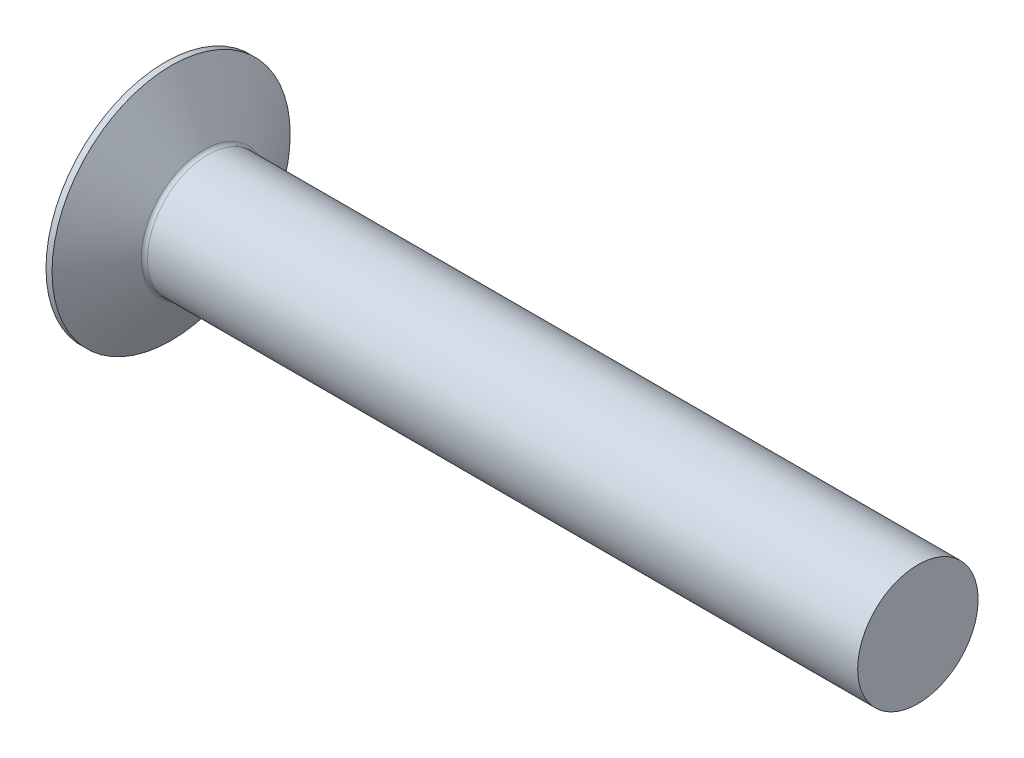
ISO-10303-21;
HEADER;
FILE_DESCRIPTION(('STEP AP214'),'2;1');
FILE_NAME('part.step','',(''),(''),'','','');
FILE_SCHEMA(('AUTOMOTIVE_DESIGN { 1 0 10303 214 1 1 1 1 }'));
ENDSEC;
DATA;
#1=APPLICATION_CONTEXT('core data for automotive mechanical design processes');
#2=APPLICATION_PROTOCOL_DEFINITION('international standard','automotive_design',2000,#1);
#3=PRODUCT_CONTEXT('',#1,'mechanical');
#4=PRODUCT('Part','Part','',(#3));
#5=PRODUCT_RELATED_PRODUCT_CATEGORY('part','',(#4));
#6=PRODUCT_DEFINITION_FORMATION('','',#4);
#7=PRODUCT_DEFINITION_CONTEXT('part definition',#1,'design');
#8=PRODUCT_DEFINITION('design','',#6,#7);
#9=PRODUCT_DEFINITION_SHAPE('','',#8);
#10=(LENGTH_UNIT() NAMED_UNIT(*) SI_UNIT(.MILLI.,.METRE.));
#11=(NAMED_UNIT(*) PLANE_ANGLE_UNIT() SI_UNIT($,.RADIAN.));
#12=(NAMED_UNIT(*) SI_UNIT($,.STERADIAN.) SOLID_ANGLE_UNIT());
#13=UNCERTAINTY_MEASURE_WITH_UNIT(LENGTH_MEASURE(1.E-05),#10,'distance_accuracy_value','');
#14=(GEOMETRIC_REPRESENTATION_CONTEXT(3) GLOBAL_UNCERTAINTY_ASSIGNED_CONTEXT((#13)) GLOBAL_UNIT_ASSIGNED_CONTEXT((#10,
#11,#12)) REPRESENTATION_CONTEXT('',''));
#15=CARTESIAN_POINT('',(0.,0.,0.));
#16=DIRECTION('',(0.,0.,1.));
#17=DIRECTION('',(1.,0.,0.));
#18=AXIS2_PLACEMENT_3D('',#15,#16,#17);
#19=CARTESIAN_POINT('',(0.,7.91000000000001,0.));
#20=DIRECTION('',(1.,0.,0.));
#21=DIRECTION('',(0.,0.,-1.));
#22=AXIS2_PLACEMENT_3D('',#19,#20,#21);
#23=PLANE('',#22);
#24=CARTESIAN_POINT('',(0.,0.,0.));
#25=DIRECTION('',(-1.,0.,0.));
#26=DIRECTION('',(0.,0.,1.));
#27=AXIS2_PLACEMENT_3D('',#24,#25,#26);
#28=CIRCLE('',#27,7.91000000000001);
#29=CARTESIAN_POINT('',(0.,0.,7.91000000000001));
#30=VERTEX_POINT('',#29);
#31=EDGE_CURVE('E10',#30,#30,#28,.T.);
#32=ORIENTED_EDGE('',*,*,#31,.T.);
#33=EDGE_LOOP('',(#32));
#34=FACE_BOUND('',#33,.T.);
#35=ADVANCED_FACE('F37',(#34),#23,.F.);
#36=CARTESIAN_POINT('',(-69.0695530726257,0.,0.));
#37=DIRECTION('',(-1.,0.,0.));
#38=DIRECTION('',(0.,0.,1.));
#39=AXIS2_PLACEMENT_3D('',#36,#37,#38);
#40=CYLINDRICAL_SURFACE('',#39,7.91000000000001);
#41=ORIENTED_EDGE('',*,*,#31,.F.);
#42=EDGE_LOOP('',(#41));
#43=FACE_BOUND('',#42,.T.);
#44=CARTESIAN_POINT('',(0.399999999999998,0.,0.));
#45=DIRECTION('',(-1.,0.,0.));
#46=DIRECTION('',(0.,0.,1.));
#47=AXIS2_PLACEMENT_3D('',#44,#45,#46);
#48=CIRCLE('',#47,7.91000000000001);
#49=CARTESIAN_POINT('',(0.399999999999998,0.,7.91000000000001));
#50=VERTEX_POINT('',#49);
#51=EDGE_CURVE('E43',#50,#50,#48,.T.);
#52=ORIENTED_EDGE('',*,*,#51,.T.);
#53=EDGE_LOOP('',(#52));
#54=FACE_BOUND('',#53,.T.);
#55=ADVANCED_FACE('F72',(#43,#54),#40,.T.);
#56=CARTESIAN_POINT('',(2.57083701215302,0.,0.));
#57=DIRECTION('',(-1.,0.,0.));
#58=DIRECTION('',(0.,0.,1.));
#59=AXIS2_PLACEMENT_3D('',#56,#57,#58);
#60=CONICAL_SURFACE('',#59,4.14999999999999,1.04719755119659);
#61=ORIENTED_EDGE('',*,*,#51,.F.);
#62=EDGE_LOOP('',(#61));
#63=FACE_BOUND('',#62,.T.);
#64=CARTESIAN_POINT('',(2.57083701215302,0.,0.));
#65=DIRECTION('',(-1.,0.,0.));
#66=DIRECTION('',(0.,0.,1.));
#67=AXIS2_PLACEMENT_3D('',#64,#65,#66);
#68=CIRCLE('',#67,4.14999999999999);
#69=CARTESIAN_POINT('',(2.57083701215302,0.,4.14999999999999));
#70=VERTEX_POINT('',#69);
#71=EDGE_CURVE('E47',#70,#70,#68,.T.);
#72=ORIENTED_EDGE('',*,*,#71,.T.);
#73=EDGE_LOOP('',(#72));
#74=FACE_BOUND('',#73,.T.);
#75=ADVANCED_FACE('F76',(#63,#74),#60,.T.);
#76=CARTESIAN_POINT('',(2.83064463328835,0.,0.));
#77=DIRECTION('',(-1.,0.,0.));
#78=DIRECTION('',(0.,0.,1.));
#79=AXIS2_PLACEMENT_3D('',#76,#77,#78);
#80=TOROIDAL_SURFACE('',#79,4.3,0.300000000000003);
#81=ORIENTED_EDGE('',*,*,#71,.F.);
#82=EDGE_LOOP('',(#81));
#83=FACE_BOUND('',#82,.T.);
#84=CARTESIAN_POINT('',(2.83064463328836,0.,0.));
#85=DIRECTION('',(-1.,0.,0.));
#86=DIRECTION('',(0.,0.,1.));
#87=AXIS2_PLACEMENT_3D('',#84,#85,#86);
#88=CIRCLE('',#87,3.99999999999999);
#89=CARTESIAN_POINT('',(2.83064463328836,0.,3.99999999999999));
#90=VERTEX_POINT('',#89);
#91=EDGE_CURVE('E51',#90,#90,#88,.T.);
#92=ORIENTED_EDGE('',*,*,#91,.T.);
#93=EDGE_LOOP('',(#92));
#94=FACE_BOUND('',#93,.T.);
#95=ADVANCED_FACE('F68',(#83,#94),#80,.F.);
#96=CARTESIAN_POINT('',(-69.0695530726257,0.,0.));
#97=DIRECTION('',(-1.,0.,0.));
#98=DIRECTION('',(0.,0.,1.));
#99=AXIS2_PLACEMENT_3D('',#96,#97,#98);
#100=CYLINDRICAL_SURFACE('',#99,4.);
#101=ORIENTED_EDGE('',*,*,#91,.F.);
#102=EDGE_LOOP('',(#101));
#103=FACE_BOUND('',#102,.T.);
#104=CARTESIAN_POINT('',(50.,0.,0.));
#105=DIRECTION('',(-1.,0.,0.));
#106=DIRECTION('',(0.,0.,1.));
#107=AXIS2_PLACEMENT_3D('',#104,#105,#106);
#108=CIRCLE('',#107,4.00000000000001);
#109=CARTESIAN_POINT('',(50.,0.,4.00000000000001));
#110=VERTEX_POINT('',#109);
#111=EDGE_CURVE('E56',#110,#110,#108,.T.);
#112=ORIENTED_EDGE('',*,*,#111,.T.);
#113=EDGE_LOOP('',(#112));
#114=FACE_BOUND('',#113,.T.);
#115=ADVANCED_FACE('F60',(#103,#114),#100,.T.);
#116=CARTESIAN_POINT('',(50.,0.,0.));
#117=DIRECTION('',(-1.,0.,0.));
#118=DIRECTION('',(0.,0.,1.));
#119=AXIS2_PLACEMENT_3D('',#116,#117,#118);
#120=PLANE('',#119);
#121=ORIENTED_EDGE('',*,*,#111,.F.);
#122=EDGE_LOOP('',(#121));
#123=FACE_BOUND('',#122,.T.);
#124=ADVANCED_FACE('F62',(#123),#120,.F.);
#125=CLOSED_SHELL('',(#35,#55,#75,#95,#115,#124));
#126=MANIFOLD_SOLID_BREP('B2',#125);
#127=ADVANCED_BREP_SHAPE_REPRESENTATION('',(#18,#126),#14);
#128=SHAPE_DEFINITION_REPRESENTATION(#9,#127);
ENDSEC;
END-ISO-10303-21;
